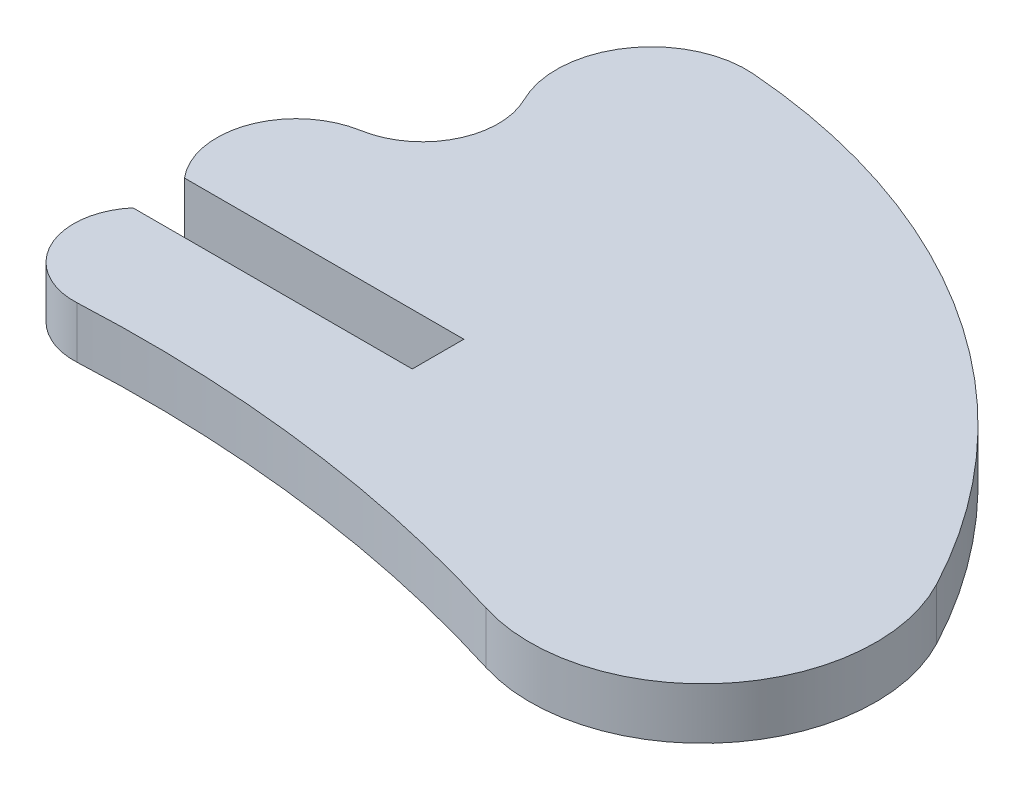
ISO-10303-21;
HEADER;
FILE_DESCRIPTION(('STEP AP214'),'2;1');
FILE_NAME('part.step','',(''),(''),'','','');
FILE_SCHEMA(('AUTOMOTIVE_DESIGN { 1 0 10303 214 1 1 1 1 }'));
ENDSEC;
DATA;
#1=APPLICATION_CONTEXT('core data for automotive mechanical design processes');
#2=APPLICATION_PROTOCOL_DEFINITION('international standard','automotive_design',2000,#1);
#3=PRODUCT_CONTEXT('',#1,'mechanical');
#4=PRODUCT('Part','Part','',(#3));
#5=PRODUCT_RELATED_PRODUCT_CATEGORY('part','',(#4));
#6=PRODUCT_DEFINITION_FORMATION('','',#4);
#7=PRODUCT_DEFINITION_CONTEXT('part definition',#1,'design');
#8=PRODUCT_DEFINITION('design','',#6,#7);
#9=PRODUCT_DEFINITION_SHAPE('','',#8);
#10=(LENGTH_UNIT() NAMED_UNIT(*) SI_UNIT(.MILLI.,.METRE.));
#11=(NAMED_UNIT(*) PLANE_ANGLE_UNIT() SI_UNIT($,.RADIAN.));
#12=(NAMED_UNIT(*) SI_UNIT($,.STERADIAN.) SOLID_ANGLE_UNIT());
#13=UNCERTAINTY_MEASURE_WITH_UNIT(LENGTH_MEASURE(1.E-05),#10,'distance_accuracy_value','');
#14=(GEOMETRIC_REPRESENTATION_CONTEXT(3) GLOBAL_UNCERTAINTY_ASSIGNED_CONTEXT((#13)) GLOBAL_UNIT_ASSIGNED_CONTEXT((#10,
#11,#12)) REPRESENTATION_CONTEXT('',''));
#15=CARTESIAN_POINT('',(0.,0.,0.));
#16=DIRECTION('',(0.,0.,1.));
#17=DIRECTION('',(1.,0.,0.));
#18=AXIS2_PLACEMENT_3D('',#15,#16,#17);
#19=CARTESIAN_POINT('',(-41743.4308736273,3.,-18228.9302134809));
#20=DIRECTION('',(0.,-1.,0.));
#21=DIRECTION('',(0.,0.,-1.));
#22=AXIS2_PLACEMENT_3D('',#19,#20,#21);
#23=CYLINDRICAL_SURFACE('',#22,10.0661919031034);
#24=CARTESIAN_POINT('',(-41743.4308736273,0.,-18228.9302134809));
#25=DIRECTION('',(0.,1.,0.));
#26=DIRECTION('',(0.,0.,1.));
#27=AXIS2_PLACEMENT_3D('',#24,#25,#26);
#28=CIRCLE('',#27,10.0661919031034);
#29=CARTESIAN_POINT('',(-41746.438604,0.,-18219.323873));
#30=VERTEX_POINT('',#29);
#31=CARTESIAN_POINT('',(-41734.53608,0.,-18233.643054));
#32=VERTEX_POINT('',#31);
#33=EDGE_CURVE('E144',#30,#32,#28,.T.);
#34=ORIENTED_EDGE('',*,*,#33,.T.);
#35=DIRECTION('',(0.,-1.,0.));
#36=VECTOR('',#35,1.);
#37=CARTESIAN_POINT('',(-41734.53608,3.,-18233.643054));
#38=LINE('',#37,#36);
#39=CARTESIAN_POINT('',(-41734.53608,3.,-18233.643054));
#40=VERTEX_POINT('',#39);
#41=EDGE_CURVE('E11',#40,#32,#38,.T.);
#42=ORIENTED_EDGE('',*,*,#41,.F.);
#43=CARTESIAN_POINT('',(-41743.4308736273,3.,-18228.9302134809));
#44=DIRECTION('',(0.,1.,0.));
#45=DIRECTION('',(0.,0.,1.));
#46=AXIS2_PLACEMENT_3D('',#43,#44,#45);
#47=CIRCLE('',#46,10.0661919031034);
#48=CARTESIAN_POINT('',(-41746.438604,3.,-18219.323873));
#49=VERTEX_POINT('',#48);
#50=EDGE_CURVE('E162',#49,#40,#47,.T.);
#51=ORIENTED_EDGE('',*,*,#50,.F.);
#52=DIRECTION('',(0.,-1.,0.));
#53=VECTOR('',#52,1.);
#54=CARTESIAN_POINT('',(-41746.438604,3.,-18219.323873));
#55=LINE('',#54,#53);
#56=EDGE_CURVE('E140',#49,#30,#55,.T.);
#57=ORIENTED_EDGE('',*,*,#56,.T.);
#58=EDGE_LOOP('',(#34,#42,#51,#57));
#59=FACE_BOUND('',#58,.T.);
#60=ADVANCED_FACE('F36',(#59),#23,.T.);
#61=CARTESIAN_POINT('',(-41768.5868768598,3.,-18215.6099919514));
#62=DIRECTION('',(0.,-1.,0.));
#63=DIRECTION('',(0.,0.,-1.));
#64=AXIS2_PLACEMENT_3D('',#61,#62,#63);
#65=CYLINDRICAL_SURFACE('',#64,38.5311314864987);
#66=CARTESIAN_POINT('',(-41768.5868768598,0.,-18215.6099919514));
#67=DIRECTION('',(0.,1.,0.));
#68=DIRECTION('',(0.,0.,1.));
#69=AXIS2_PLACEMENT_3D('',#66,#67,#68);
#70=CIRCLE('',#69,38.5311314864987);
#71=CARTESIAN_POINT('',(-41765.5841989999,0.,-18254.023948));
#72=VERTEX_POINT('',#71);
#73=EDGE_CURVE('E147',#32,#72,#70,.T.);
#74=ORIENTED_EDGE('',*,*,#73,.T.);
#75=DIRECTION('',(0.,-1.,0.));
#76=VECTOR('',#75,1.);
#77=CARTESIAN_POINT('',(-41765.5841989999,3.,-18254.023948));
#78=LINE('',#77,#76);
#79=CARTESIAN_POINT('',(-41765.5841989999,3.,-18254.023948));
#80=VERTEX_POINT('',#79);
#81=EDGE_CURVE('E44',#80,#72,#78,.T.);
#82=ORIENTED_EDGE('',*,*,#81,.F.);
#83=CARTESIAN_POINT('',(-41768.5868768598,3.,-18215.6099919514));
#84=DIRECTION('',(0.,1.,0.));
#85=DIRECTION('',(0.,0.,1.));
#86=AXIS2_PLACEMENT_3D('',#83,#84,#85);
#87=CIRCLE('',#86,38.5311314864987);
#88=EDGE_CURVE('E101',#40,#80,#87,.T.);
#89=ORIENTED_EDGE('',*,*,#88,.F.);
#90=ORIENTED_EDGE('',*,*,#41,.T.);
#91=EDGE_LOOP('',(#74,#82,#89,#90));
#92=FACE_BOUND('',#91,.T.);
#93=ADVANCED_FACE('F211',(#92),#65,.T.);
#94=CARTESIAN_POINT('',(-41766.0155015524,3.,-18248.5197140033));
#95=DIRECTION('',(0.,-1.,0.));
#96=DIRECTION('',(0.,0.,-1.));
#97=AXIS2_PLACEMENT_3D('',#94,#95,#96);
#98=CYLINDRICAL_SURFACE('',#97,5.52110621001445);
#99=CARTESIAN_POINT('',(-41766.0155015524,0.,-18248.5197140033));
#100=DIRECTION('',(0.,1.,0.));
#101=DIRECTION('',(0.,0.,1.));
#102=AXIS2_PLACEMENT_3D('',#99,#100,#101);
#103=CIRCLE('',#102,5.52110621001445);
#104=CARTESIAN_POINT('',(-41770.957559,0.,-18246.058275));
#105=VERTEX_POINT('',#104);
#106=EDGE_CURVE('E149',#72,#105,#103,.T.);
#107=ORIENTED_EDGE('',*,*,#106,.T.);
#108=DIRECTION('',(0.,-1.,0.));
#109=VECTOR('',#108,1.);
#110=CARTESIAN_POINT('',(-41770.957559,3.,-18246.058275));
#111=LINE('',#110,#109);
#112=CARTESIAN_POINT('',(-41770.957559,3.,-18246.058275));
#113=VERTEX_POINT('',#112);
#114=EDGE_CURVE('E175',#113,#105,#111,.T.);
#115=ORIENTED_EDGE('',*,*,#114,.F.);
#116=CARTESIAN_POINT('',(-41766.0155015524,3.,-18248.5197140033));
#117=DIRECTION('',(0.,1.,0.));
#118=DIRECTION('',(0.,0.,1.));
#119=AXIS2_PLACEMENT_3D('',#116,#117,#118);
#120=CIRCLE('',#119,5.52110621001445);
#121=EDGE_CURVE('E183',#80,#113,#120,.T.);
#122=ORIENTED_EDGE('',*,*,#121,.F.);
#123=ORIENTED_EDGE('',*,*,#81,.T.);
#124=EDGE_LOOP('',(#107,#115,#122,#123));
#125=FACE_BOUND('',#124,.T.);
#126=ADVANCED_FACE('F181',(#125),#98,.T.);
#127=CARTESIAN_POINT('',(-41774.905820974,3.,-18244.0926441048));
#128=DIRECTION('',(0.,-1.,0.));
#129=DIRECTION('',(0.,0.,-1.));
#130=AXIS2_PLACEMENT_3D('',#127,#128,#129);
#131=CYLINDRICAL_SURFACE('',#130,4.41049627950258);
#132=CARTESIAN_POINT('',(-41774.905820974,0.,-18244.0926441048));
#133=DIRECTION('',(0.,-1.,0.));
#134=DIRECTION('',(0.,0.,1.));
#135=AXIS2_PLACEMENT_3D('',#132,#133,#134);
#136=CIRCLE('',#135,4.41049627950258);
#137=CARTESIAN_POINT('',(-41774.154142,0.,-18239.746674));
#138=VERTEX_POINT('',#137);
#139=EDGE_CURVE('E151',#105,#138,#136,.T.);
#140=ORIENTED_EDGE('',*,*,#139,.T.);
#141=DIRECTION('',(0.,-1.,0.));
#142=VECTOR('',#141,1.);
#143=CARTESIAN_POINT('',(-41774.154142,3.,-18239.746674));
#144=LINE('',#143,#142);
#145=CARTESIAN_POINT('',(-41774.154142,3.,-18239.746674));
#146=VERTEX_POINT('',#145);
#147=EDGE_CURVE('E172',#146,#138,#144,.T.);
#148=ORIENTED_EDGE('',*,*,#147,.F.);
#149=CARTESIAN_POINT('',(-41774.905820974,3.,-18244.0926441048));
#150=DIRECTION('',(0.,-1.,0.));
#151=DIRECTION('',(0.,0.,1.));
#152=AXIS2_PLACEMENT_3D('',#149,#150,#151);
#153=CIRCLE('',#152,4.41049627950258);
#154=EDGE_CURVE('E201',#113,#146,#153,.T.);
#155=ORIENTED_EDGE('',*,*,#154,.F.);
#156=ORIENTED_EDGE('',*,*,#114,.T.);
#157=EDGE_LOOP('',(#140,#148,#155,#156));
#158=FACE_BOUND('',#157,.T.);
#159=ADVANCED_FACE('F192',(#158),#131,.F.);
#160=CARTESIAN_POINT('',(-41773.3720447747,3.,-18235.2044130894));
#161=DIRECTION('',(0.,-1.,0.));
#162=DIRECTION('',(0.,0.,-1.));
#163=AXIS2_PLACEMENT_3D('',#160,#161,#162);
#164=CYLINDRICAL_SURFACE('',#163,4.60910080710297);
#165=CARTESIAN_POINT('',(-41773.3720447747,0.,-18235.2044130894));
#166=DIRECTION('',(0.,1.,0.));
#167=DIRECTION('',(0.,0.,1.));
#168=AXIS2_PLACEMENT_3D('',#165,#166,#167);
#169=CIRCLE('',#168,4.60910080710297);
#170=CARTESIAN_POINT('',(-41776.886719,0.,-18232.222656));
#171=VERTEX_POINT('',#170);
#172=EDGE_CURVE('E153',#138,#171,#169,.T.);
#173=ORIENTED_EDGE('',*,*,#172,.T.);
#174=DIRECTION('',(0.,-1.,0.));
#175=VECTOR('',#174,1.);
#176=CARTESIAN_POINT('',(-41776.886719,3.,-18232.222656));
#177=LINE('',#176,#175);
#178=CARTESIAN_POINT('',(-41776.886719,3.,-18232.222656));
#179=VERTEX_POINT('',#178);
#180=EDGE_CURVE('E169',#179,#171,#177,.T.);
#181=ORIENTED_EDGE('',*,*,#180,.F.);
#182=CARTESIAN_POINT('',(-41773.3720447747,3.,-18235.2044130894));
#183=DIRECTION('',(0.,1.,0.));
#184=DIRECTION('',(0.,0.,1.));
#185=AXIS2_PLACEMENT_3D('',#182,#183,#184);
#186=CIRCLE('',#185,4.60910080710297);
#187=EDGE_CURVE('E198',#146,#179,#186,.T.);
#188=ORIENTED_EDGE('',*,*,#187,.F.);
#189=ORIENTED_EDGE('',*,*,#147,.T.);
#190=EDGE_LOOP('',(#173,#181,#188,#189));
#191=FACE_BOUND('',#190,.T.);
#192=ADVANCED_FACE('F196',(#191),#164,.T.);
#193=CARTESIAN_POINT('',(-41760.636719,3.,-18232.226562));
#194=DIRECTION('',(-0.000240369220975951,0.,-0.999999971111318));
#195=DIRECTION('',(-0.999999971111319,0.,0.000240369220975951));
#196=AXIS2_PLACEMENT_3D('',#193,#194,#195);
#197=PLANE('',#196);
#198=DIRECTION('',(0.999999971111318,0.,-0.000240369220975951));
#199=VECTOR('',#198,1.);
#200=CARTESIAN_POINT('',(-41760.636719,0.,-18232.226562));
#201=LINE('',#200,#199);
#202=CARTESIAN_POINT('',(-41760.636719,0.,-18232.226562));
#203=VERTEX_POINT('',#202);
#204=EDGE_CURVE('E155',#171,#203,#201,.T.);
#205=ORIENTED_EDGE('',*,*,#204,.T.);
#206=DIRECTION('',(0.,-1.,0.));
#207=VECTOR('',#206,1.);
#208=CARTESIAN_POINT('',(-41760.636719,3.,-18232.226562));
#209=LINE('',#208,#207);
#210=CARTESIAN_POINT('',(-41760.636719,3.,-18232.226562));
#211=VERTEX_POINT('',#210);
#212=EDGE_CURVE('E166',#211,#203,#209,.T.);
#213=ORIENTED_EDGE('',*,*,#212,.F.);
#214=DIRECTION('',(0.999999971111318,0.,-0.000240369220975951));
#215=VECTOR('',#214,1.);
#216=CARTESIAN_POINT('',(-41760.636719,3.,-18232.226562));
#217=LINE('',#216,#215);
#218=EDGE_CURVE('E200',#179,#211,#217,.T.);
#219=ORIENTED_EDGE('',*,*,#218,.F.);
#220=ORIENTED_EDGE('',*,*,#180,.T.);
#221=EDGE_LOOP('',(#205,#213,#219,#220));
#222=FACE_BOUND('',#221,.T.);
#223=ADVANCED_FACE('F223',(#222),#197,.F.);
#224=CARTESIAN_POINT('',(-41760.636719,3.,-18229.226562));
#225=DIRECTION('',(1.,0.,0.));
#226=DIRECTION('',(0.,0.,-1.));
#227=AXIS2_PLACEMENT_3D('',#224,#225,#226);
#228=PLANE('',#227);
#229=DIRECTION('',(0.,0.,1.));
#230=VECTOR('',#229,1.);
#231=CARTESIAN_POINT('',(-41760.636719,0.,-18229.226562));
#232=LINE('',#231,#230);
#233=CARTESIAN_POINT('',(-41760.636719,0.,-18229.226562));
#234=VERTEX_POINT('',#233);
#235=EDGE_CURVE('E157',#203,#234,#232,.T.);
#236=ORIENTED_EDGE('',*,*,#235,.T.);
#237=DIRECTION('',(0.,-1.,0.));
#238=VECTOR('',#237,1.);
#239=CARTESIAN_POINT('',(-41760.636719,3.,-18229.226562));
#240=LINE('',#239,#238);
#241=CARTESIAN_POINT('',(-41760.636719,3.,-18229.226562));
#242=VERTEX_POINT('',#241);
#243=EDGE_CURVE('E135',#242,#234,#240,.T.);
#244=ORIENTED_EDGE('',*,*,#243,.F.);
#245=DIRECTION('',(0.,0.,1.));
#246=VECTOR('',#245,1.);
#247=CARTESIAN_POINT('',(-41760.636719,3.,-18229.226562));
#248=LINE('',#247,#246);
#249=EDGE_CURVE('E126',#211,#242,#248,.T.);
#250=ORIENTED_EDGE('',*,*,#249,.F.);
#251=ORIENTED_EDGE('',*,*,#212,.T.);
#252=EDGE_LOOP('',(#236,#244,#250,#251));
#253=FACE_BOUND('',#252,.T.);
#254=ADVANCED_FACE('F226',(#253),#228,.F.);
#255=CARTESIAN_POINT('',(-41776.885247,3.,-18229.221443));
#256=DIRECTION('',(0.000315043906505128,0.,0.999999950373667));
#257=DIRECTION('',(0.999999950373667,0.,-0.000315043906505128));
#258=AXIS2_PLACEMENT_3D('',#255,#256,#257);
#259=PLANE('',#258);
#260=DIRECTION('',(-0.999999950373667,0.,0.000315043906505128));
#261=VECTOR('',#260,1.);
#262=CARTESIAN_POINT('',(-41776.885247,0.,-18229.221443));
#263=LINE('',#262,#261);
#264=CARTESIAN_POINT('',(-41776.885247,0.,-18229.221443));
#265=VERTEX_POINT('',#264);
#266=EDGE_CURVE('E134',#234,#265,#263,.T.);
#267=ORIENTED_EDGE('',*,*,#266,.T.);
#268=DIRECTION('',(0.,-1.,0.));
#269=VECTOR('',#268,1.);
#270=CARTESIAN_POINT('',(-41776.885247,3.,-18229.221443));
#271=LINE('',#270,#269);
#272=CARTESIAN_POINT('',(-41776.885247,3.,-18229.221443));
#273=VERTEX_POINT('',#272);
#274=EDGE_CURVE('E131',#273,#265,#271,.T.);
#275=ORIENTED_EDGE('',*,*,#274,.F.);
#276=DIRECTION('',(-0.999999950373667,0.,0.000315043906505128));
#277=VECTOR('',#276,1.);
#278=CARTESIAN_POINT('',(-41776.885247,3.,-18229.221443));
#279=LINE('',#278,#277);
#280=EDGE_CURVE('E120',#242,#273,#279,.T.);
#281=ORIENTED_EDGE('',*,*,#280,.F.);
#282=ORIENTED_EDGE('',*,*,#243,.T.);
#283=EDGE_LOOP('',(#267,#275,#281,#282));
#284=FACE_BOUND('',#283,.T.);
#285=ADVANCED_FACE('F132',(#284),#259,.F.);
#286=CARTESIAN_POINT('',(-41773.9179034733,3.,-18226.6990860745));
#287=DIRECTION('',(0.,-1.,0.));
#288=DIRECTION('',(0.,0.,-1.));
#289=AXIS2_PLACEMENT_3D('',#286,#287,#288);
#290=CYLINDRICAL_SURFACE('',#289,3.89453618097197);
#291=CARTESIAN_POINT('',(-41773.9179034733,0.,-18226.6990860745));
#292=DIRECTION('',(0.,1.,0.));
#293=DIRECTION('',(0.,0.,1.));
#294=AXIS2_PLACEMENT_3D('',#291,#292,#293);
#295=CIRCLE('',#294,3.89453618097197);
#296=CARTESIAN_POINT('',(-41773.7243610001,0.,-18222.809362));
#297=VERTEX_POINT('',#296);
#298=EDGE_CURVE('E87',#265,#297,#295,.T.);
#299=ORIENTED_EDGE('',*,*,#298,.T.);
#300=DIRECTION('',(0.,-1.,0.));
#301=VECTOR('',#300,1.);
#302=CARTESIAN_POINT('',(-41773.7243610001,3.,-18222.809362));
#303=LINE('',#302,#301);
#304=CARTESIAN_POINT('',(-41773.7243610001,3.,-18222.809362));
#305=VERTEX_POINT('',#304);
#306=EDGE_CURVE('E136',#305,#297,#303,.T.);
#307=ORIENTED_EDGE('',*,*,#306,.F.);
#308=CARTESIAN_POINT('',(-41773.9179034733,3.,-18226.6990860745));
#309=DIRECTION('',(0.,1.,0.));
#310=DIRECTION('',(0.,0.,1.));
#311=AXIS2_PLACEMENT_3D('',#308,#309,#310);
#312=CIRCLE('',#311,3.89453618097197);
#313=EDGE_CURVE('E124',#273,#305,#312,.T.);
#314=ORIENTED_EDGE('',*,*,#313,.F.);
#315=ORIENTED_EDGE('',*,*,#274,.T.);
#316=EDGE_LOOP('',(#299,#307,#314,#315));
#317=FACE_BOUND('',#316,.T.);
#318=ADVANCED_FACE('F138',(#317),#290,.T.);
#319=CARTESIAN_POINT('',(-41769.8593757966,3.,-18144.5214841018));
#320=DIRECTION('',(0.,-1.,0.));
#321=DIRECTION('',(0.,0.,-1.));
#322=AXIS2_PLACEMENT_3D('',#319,#320,#321);
#323=CYLINDRICAL_SURFACE('',#322,78.3832248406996);
#324=CARTESIAN_POINT('',(-41769.8593757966,0.,-18144.5214841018));
#325=DIRECTION('',(0.,-1.,0.));
#326=DIRECTION('',(0.,0.,1.));
#327=AXIS2_PLACEMENT_3D('',#324,#325,#326);
#328=CIRCLE('',#327,78.3832248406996);
#329=EDGE_CURVE('E93',#297,#30,#328,.T.);
#330=ORIENTED_EDGE('',*,*,#329,.T.);
#331=ORIENTED_EDGE('',*,*,#56,.F.);
#332=CARTESIAN_POINT('',(-41769.8593757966,3.,-18144.5214841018));
#333=DIRECTION('',(0.,-1.,0.));
#334=DIRECTION('',(0.,0.,1.));
#335=AXIS2_PLACEMENT_3D('',#332,#333,#334);
#336=CIRCLE('',#335,78.3832248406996);
#337=EDGE_CURVE('E52',#305,#49,#336,.T.);
#338=ORIENTED_EDGE('',*,*,#337,.F.);
#339=ORIENTED_EDGE('',*,*,#306,.T.);
#340=EDGE_LOOP('',(#330,#331,#338,#339));
#341=FACE_BOUND('',#340,.T.);
#342=ADVANCED_FACE('F235',(#341),#323,.F.);
#343=CARTESIAN_POINT('',(-41743.4308736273,3.,-18228.9302134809));
#344=DIRECTION('',(0.,1.,0.));
#345=DIRECTION('',(0.,0.,1.));
#346=AXIS2_PLACEMENT_3D('',#343,#344,#345);
#347=PLANE('',#346);
#348=ORIENTED_EDGE('',*,*,#50,.T.);
#349=ORIENTED_EDGE('',*,*,#88,.T.);
#350=ORIENTED_EDGE('',*,*,#121,.T.);
#351=ORIENTED_EDGE('',*,*,#154,.T.);
#352=ORIENTED_EDGE('',*,*,#187,.T.);
#353=ORIENTED_EDGE('',*,*,#218,.T.);
#354=ORIENTED_EDGE('',*,*,#249,.T.);
#355=ORIENTED_EDGE('',*,*,#280,.T.);
#356=ORIENTED_EDGE('',*,*,#313,.T.);
#357=ORIENTED_EDGE('',*,*,#337,.T.);
#358=EDGE_LOOP('',(#348,#349,#350,#351,#352,#353,#354,#355,#356,#357));
#359=FACE_BOUND('',#358,.T.);
#360=ADVANCED_FACE('F122',(#359),#347,.T.);
#361=CARTESIAN_POINT('',(-41743.4308736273,0.,-18228.9302134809));
#362=DIRECTION('',(0.,1.,0.));
#363=DIRECTION('',(0.,0.,1.));
#364=AXIS2_PLACEMENT_3D('',#361,#362,#363);
#365=PLANE('',#364);
#366=ORIENTED_EDGE('',*,*,#33,.F.);
#367=ORIENTED_EDGE('',*,*,#329,.F.);
#368=ORIENTED_EDGE('',*,*,#298,.F.);
#369=ORIENTED_EDGE('',*,*,#266,.F.);
#370=ORIENTED_EDGE('',*,*,#235,.F.);
#371=ORIENTED_EDGE('',*,*,#204,.F.);
#372=ORIENTED_EDGE('',*,*,#172,.F.);
#373=ORIENTED_EDGE('',*,*,#139,.F.);
#374=ORIENTED_EDGE('',*,*,#106,.F.);
#375=ORIENTED_EDGE('',*,*,#73,.F.);
#376=EDGE_LOOP('',(#366,#367,#368,#369,#370,#371,#372,#373,#374,#375));
#377=FACE_BOUND('',#376,.T.);
#378=ADVANCED_FACE('F187',(#377),#365,.F.);
#379=CLOSED_SHELL('',(#60,#93,#126,#159,#192,#223,#254,#285,#318,#342,#360,#378));
#380=MANIFOLD_SOLID_BREP('B2',#379);
#381=ADVANCED_BREP_SHAPE_REPRESENTATION('',(#18,#380),#14);
#382=SHAPE_DEFINITION_REPRESENTATION(#9,#381);
ENDSEC;
END-ISO-10303-21;
